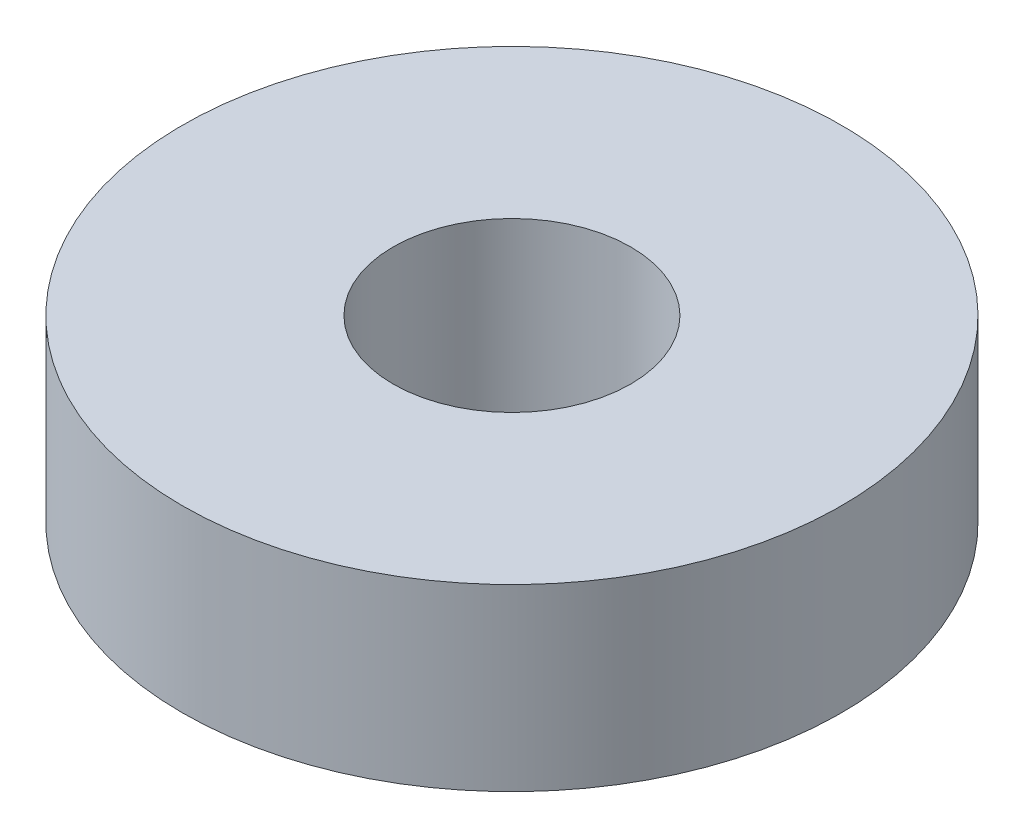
from build123d import *

# Parameters (mm, degrees)
SKETCH1_R           = 9.3345
SKETCH1_R_2         = 3.3655
BOSS_EXTRUDE1_DEPTH = 5.08


with BuildPart() as part:
    # Sketch1 → Boss-Extrude1 (new body)
    with BuildSketch(Plane(origin=(0, 0, 0), x_dir=(1, 0, 0), z_dir=(0, 1, 0))):
        with Locations(Location((0, 0, 0), (0, 0, 270))):
            Circle(SKETCH1_R)
        with Locations(Location((0, 0, 0), (0, 0, 270))):
            Circle(SKETCH1_R_2, mode=Mode.SUBTRACT)
    extrude(amount=BOSS_EXTRUDE1_DEPTH)


solid = part.part
